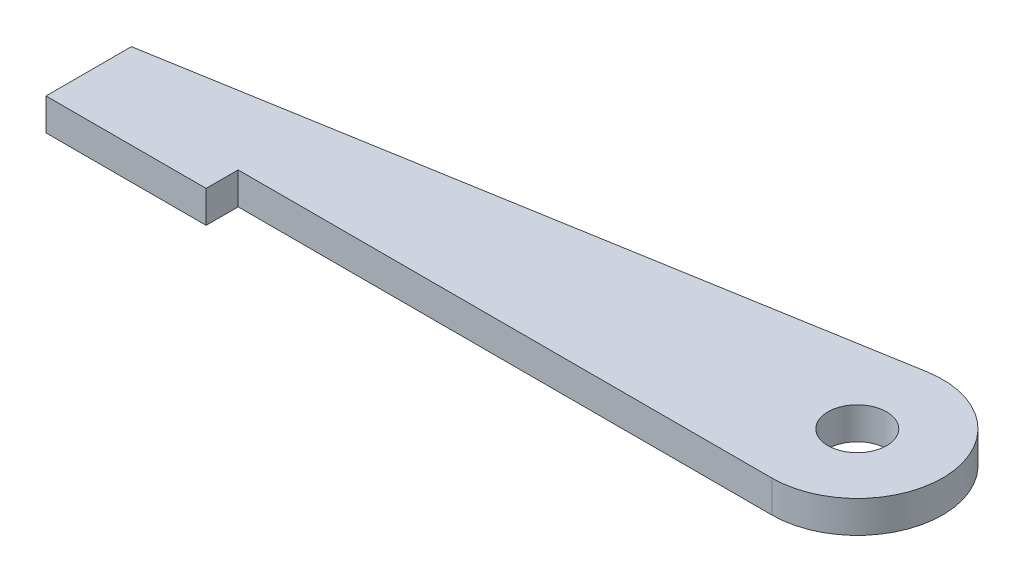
ISO-10303-21;
HEADER;
FILE_DESCRIPTION(('STEP AP214'),'2;1');
FILE_NAME('part.step','',(''),(''),'','','');
FILE_SCHEMA(('AUTOMOTIVE_DESIGN { 1 0 10303 214 1 1 1 1 }'));
ENDSEC;
DATA;
#1=APPLICATION_CONTEXT('core data for automotive mechanical design processes');
#2=APPLICATION_PROTOCOL_DEFINITION('international standard','automotive_design',2000,#1);
#3=PRODUCT_CONTEXT('',#1,'mechanical');
#4=PRODUCT('Part','Part','',(#3));
#5=PRODUCT_RELATED_PRODUCT_CATEGORY('part','',(#4));
#6=PRODUCT_DEFINITION_FORMATION('','',#4);
#7=PRODUCT_DEFINITION_CONTEXT('part definition',#1,'design');
#8=PRODUCT_DEFINITION('design','',#6,#7);
#9=PRODUCT_DEFINITION_SHAPE('','',#8);
#10=(LENGTH_UNIT() NAMED_UNIT(*) SI_UNIT(.MILLI.,.METRE.));
#11=(NAMED_UNIT(*) PLANE_ANGLE_UNIT() SI_UNIT($,.RADIAN.));
#12=(NAMED_UNIT(*) SI_UNIT($,.STERADIAN.) SOLID_ANGLE_UNIT());
#13=UNCERTAINTY_MEASURE_WITH_UNIT(LENGTH_MEASURE(1.E-05),#10,'distance_accuracy_value','');
#14=(GEOMETRIC_REPRESENTATION_CONTEXT(3) GLOBAL_UNCERTAINTY_ASSIGNED_CONTEXT((#13)) GLOBAL_UNIT_ASSIGNED_CONTEXT((#10,
#11,#12)) REPRESENTATION_CONTEXT('',''));
#15=CARTESIAN_POINT('',(0.,0.,0.));
#16=DIRECTION('',(0.,0.,1.));
#17=DIRECTION('',(1.,0.,0.));
#18=AXIS2_PLACEMENT_3D('',#15,#16,#17);
#19=CARTESIAN_POINT('',(65.0000000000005,3.,-2.99999999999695));
#20=DIRECTION('',(0.,1.,0.));
#21=DIRECTION('',(0.,0.,1.));
#22=AXIS2_PLACEMENT_3D('',#19,#20,#21);
#23=PLANE('',#22);
#24=DIRECTION('',(-0.985689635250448,0.,0.168570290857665));
#25=VECTOR('',#24,1.);
#26=CARTESIAN_POINT('',(0.,3.,0.));
#27=LINE('',#26,#25);
#28=CARTESIAN_POINT('',(63.6514376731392,3.,-10.8855170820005));
#29=VERTEX_POINT('',#28);
#30=CARTESIAN_POINT('',(0.,3.,0.));
#31=VERTEX_POINT('',#30);
#32=EDGE_CURVE('E118',#29,#31,#27,.T.);
#33=ORIENTED_EDGE('',*,*,#32,.T.);
#34=DIRECTION('',(0.,0.,1.));
#35=VECTOR('',#34,1.);
#36=CARTESIAN_POINT('',(0.,3.,0.));
#37=LINE('',#36,#35);
#38=CARTESIAN_POINT('',(0.,3.,8.));
#39=VERTEX_POINT('',#38);
#40=EDGE_CURVE('E99',#31,#39,#37,.T.);
#41=ORIENTED_EDGE('',*,*,#40,.T.);
#42=DIRECTION('',(1.,0.,0.));
#43=VECTOR('',#42,1.);
#44=CARTESIAN_POINT('',(0.,3.,8.));
#45=LINE('',#44,#43);
#46=CARTESIAN_POINT('',(15.,3.,8.));
#47=VERTEX_POINT('',#46);
#48=EDGE_CURVE('E121',#39,#47,#45,.T.);
#49=ORIENTED_EDGE('',*,*,#48,.T.);
#50=DIRECTION('',(0.,0.,-1.));
#51=VECTOR('',#50,1.);
#52=CARTESIAN_POINT('',(15.,3.,8.));
#53=LINE('',#52,#51);
#54=CARTESIAN_POINT('',(15.,3.,5.00000000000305));
#55=VERTEX_POINT('',#54);
#56=EDGE_CURVE('E123',#47,#55,#53,.T.);
#57=ORIENTED_EDGE('',*,*,#56,.T.);
#58=DIRECTION('',(1.,0.,0.));
#59=VECTOR('',#58,1.);
#60=CARTESIAN_POINT('',(15.,3.,5.00000000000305));
#61=LINE('',#60,#59);
#62=CARTESIAN_POINT('',(65.0000000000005,3.,5.00000000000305));
#63=VERTEX_POINT('',#62);
#64=EDGE_CURVE('E52',#55,#63,#61,.T.);
#65=ORIENTED_EDGE('',*,*,#64,.T.);
#66=CARTESIAN_POINT('',(65.0000000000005,3.,-2.99999999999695));
#67=DIRECTION('',(0.,1.,0.));
#68=DIRECTION('',(0.,0.,1.));
#69=AXIS2_PLACEMENT_3D('',#66,#67,#68);
#70=CIRCLE('',#69,8.);
#71=EDGE_CURVE('E47',#63,#29,#70,.T.);
#72=ORIENTED_EDGE('',*,*,#71,.T.);
#73=EDGE_LOOP('',(#33,#41,#49,#57,#65,#72));
#74=FACE_BOUND('',#73,.T.);
#75=CARTESIAN_POINT('',(65.0000000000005,3.,-2.99999999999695));
#76=DIRECTION('',(0.,1.,0.));
#77=DIRECTION('',(0.,0.,1.));
#78=AXIS2_PLACEMENT_3D('',#75,#76,#77);
#79=CIRCLE('',#78,2.75000000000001);
#80=CARTESIAN_POINT('',(65.0000000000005,3.,-0.249999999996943));
#81=VERTEX_POINT('',#80);
#82=EDGE_CURVE('E104',#81,#81,#79,.T.);
#83=ORIENTED_EDGE('',*,*,#82,.F.);
#84=EDGE_LOOP('',(#83));
#85=FACE_BOUND('',#84,.T.);
#86=ADVANCED_FACE('F32',(#74,#85),#23,.T.);
#87=CARTESIAN_POINT('',(65.0000000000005,0.,-2.99999999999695));
#88=DIRECTION('',(0.,1.,0.));
#89=DIRECTION('',(0.,0.,1.));
#90=AXIS2_PLACEMENT_3D('',#87,#88,#89);
#91=PLANE('',#90);
#92=DIRECTION('',(-0.985689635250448,0.,0.168570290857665));
#93=VECTOR('',#92,1.);
#94=CARTESIAN_POINT('',(0.,0.,0.));
#95=LINE('',#94,#93);
#96=CARTESIAN_POINT('',(63.6514376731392,0.,-10.8855170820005));
#97=VERTEX_POINT('',#96);
#98=CARTESIAN_POINT('',(0.,0.,0.));
#99=VERTEX_POINT('',#98);
#100=EDGE_CURVE('E90',#97,#99,#95,.T.);
#101=ORIENTED_EDGE('',*,*,#100,.F.);
#102=CARTESIAN_POINT('',(65.0000000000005,0.,-2.99999999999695));
#103=DIRECTION('',(0.,1.,0.));
#104=DIRECTION('',(0.,0.,1.));
#105=AXIS2_PLACEMENT_3D('',#102,#103,#104);
#106=CIRCLE('',#105,8.);
#107=CARTESIAN_POINT('',(65.0000000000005,0.,5.00000000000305));
#108=VERTEX_POINT('',#107);
#109=EDGE_CURVE('E116',#108,#97,#106,.T.);
#110=ORIENTED_EDGE('',*,*,#109,.F.);
#111=DIRECTION('',(1.,0.,0.));
#112=VECTOR('',#111,1.);
#113=CARTESIAN_POINT('',(15.,0.,5.00000000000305));
#114=LINE('',#113,#112);
#115=CARTESIAN_POINT('',(15.,0.,5.00000000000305));
#116=VERTEX_POINT('',#115);
#117=EDGE_CURVE('E114',#116,#108,#114,.T.);
#118=ORIENTED_EDGE('',*,*,#117,.F.);
#119=DIRECTION('',(0.,0.,-1.));
#120=VECTOR('',#119,1.);
#121=CARTESIAN_POINT('',(15.,0.,8.));
#122=LINE('',#121,#120);
#123=CARTESIAN_POINT('',(15.,0.,8.));
#124=VERTEX_POINT('',#123);
#125=EDGE_CURVE('E112',#124,#116,#122,.T.);
#126=ORIENTED_EDGE('',*,*,#125,.F.);
#127=DIRECTION('',(1.,0.,0.));
#128=VECTOR('',#127,1.);
#129=CARTESIAN_POINT('',(0.,0.,8.));
#130=LINE('',#129,#128);
#131=CARTESIAN_POINT('',(0.,0.,8.));
#132=VERTEX_POINT('',#131);
#133=EDGE_CURVE('E92',#132,#124,#130,.T.);
#134=ORIENTED_EDGE('',*,*,#133,.F.);
#135=DIRECTION('',(0.,0.,1.));
#136=VECTOR('',#135,1.);
#137=CARTESIAN_POINT('',(0.,0.,0.));
#138=LINE('',#137,#136);
#139=EDGE_CURVE('E85',#99,#132,#138,.T.);
#140=ORIENTED_EDGE('',*,*,#139,.F.);
#141=EDGE_LOOP('',(#101,#110,#118,#126,#134,#140));
#142=FACE_BOUND('',#141,.T.);
#143=CARTESIAN_POINT('',(65.0000000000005,0.,-2.99999999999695));
#144=DIRECTION('',(0.,1.,0.));
#145=DIRECTION('',(0.,0.,1.));
#146=AXIS2_PLACEMENT_3D('',#143,#144,#145);
#147=CIRCLE('',#146,2.75000000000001);
#148=CARTESIAN_POINT('',(65.0000000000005,0.,-0.249999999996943));
#149=VERTEX_POINT('',#148);
#150=EDGE_CURVE('E107',#149,#149,#147,.T.);
#151=ORIENTED_EDGE('',*,*,#150,.T.);
#152=EDGE_LOOP('',(#151));
#153=FACE_BOUND('',#152,.T.);
#154=ADVANCED_FACE('F86',(#142,#153),#91,.F.);
#155=CARTESIAN_POINT('',(0.,3.,0.));
#156=DIRECTION('',(0.168570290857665,0.,0.985689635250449));
#157=DIRECTION('',(0.985689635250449,0.,-0.168570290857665));
#158=AXIS2_PLACEMENT_3D('',#155,#156,#157);
#159=PLANE('',#158);
#160=ORIENTED_EDGE('',*,*,#100,.T.);
#161=DIRECTION('',(0.,-1.,0.));
#162=VECTOR('',#161,1.);
#163=CARTESIAN_POINT('',(0.,3.,0.));
#164=LINE('',#163,#162);
#165=EDGE_CURVE('E11',#31,#99,#164,.T.);
#166=ORIENTED_EDGE('',*,*,#165,.F.);
#167=ORIENTED_EDGE('',*,*,#32,.F.);
#168=DIRECTION('',(0.,-1.,0.));
#169=VECTOR('',#168,1.);
#170=CARTESIAN_POINT('',(63.6514376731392,3.,-10.8855170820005));
#171=LINE('',#170,#169);
#172=EDGE_CURVE('E103',#29,#97,#171,.T.);
#173=ORIENTED_EDGE('',*,*,#172,.T.);
#174=EDGE_LOOP('',(#160,#166,#167,#173));
#175=FACE_BOUND('',#174,.T.);
#176=ADVANCED_FACE('F34',(#175),#159,.F.);
#177=CARTESIAN_POINT('',(0.,3.,0.));
#178=DIRECTION('',(1.,0.,0.));
#179=DIRECTION('',(0.,0.,-1.));
#180=AXIS2_PLACEMENT_3D('',#177,#178,#179);
#181=PLANE('',#180);
#182=ORIENTED_EDGE('',*,*,#139,.T.);
#183=DIRECTION('',(0.,-1.,0.));
#184=VECTOR('',#183,1.);
#185=CARTESIAN_POINT('',(0.,3.,8.));
#186=LINE('',#185,#184);
#187=EDGE_CURVE('E40',#39,#132,#186,.T.);
#188=ORIENTED_EDGE('',*,*,#187,.F.);
#189=ORIENTED_EDGE('',*,*,#40,.F.);
#190=ORIENTED_EDGE('',*,*,#165,.T.);
#191=EDGE_LOOP('',(#182,#188,#189,#190));
#192=FACE_BOUND('',#191,.T.);
#193=ADVANCED_FACE('F98',(#192),#181,.F.);
#194=CARTESIAN_POINT('',(0.,3.,8.));
#195=DIRECTION('',(0.,0.,-1.));
#196=DIRECTION('',(-1.,0.,0.));
#197=AXIS2_PLACEMENT_3D('',#194,#195,#196);
#198=PLANE('',#197);
#199=ORIENTED_EDGE('',*,*,#133,.T.);
#200=DIRECTION('',(0.,-1.,0.));
#201=VECTOR('',#200,1.);
#202=CARTESIAN_POINT('',(15.,3.,8.));
#203=LINE('',#202,#201);
#204=EDGE_CURVE('E134',#47,#124,#203,.T.);
#205=ORIENTED_EDGE('',*,*,#204,.F.);
#206=ORIENTED_EDGE('',*,*,#48,.F.);
#207=ORIENTED_EDGE('',*,*,#187,.T.);
#208=EDGE_LOOP('',(#199,#205,#206,#207));
#209=FACE_BOUND('',#208,.T.);
#210=ADVANCED_FACE('F138',(#209),#198,.F.);
#211=CARTESIAN_POINT('',(15.,3.,8.));
#212=DIRECTION('',(-1.,0.,0.));
#213=DIRECTION('',(0.,0.,1.));
#214=AXIS2_PLACEMENT_3D('',#211,#212,#213);
#215=PLANE('',#214);
#216=ORIENTED_EDGE('',*,*,#125,.T.);
#217=DIRECTION('',(0.,-1.,0.));
#218=VECTOR('',#217,1.);
#219=CARTESIAN_POINT('',(15.,3.,5.00000000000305));
#220=LINE('',#219,#218);
#221=EDGE_CURVE('E131',#55,#116,#220,.T.);
#222=ORIENTED_EDGE('',*,*,#221,.F.);
#223=ORIENTED_EDGE('',*,*,#56,.F.);
#224=ORIENTED_EDGE('',*,*,#204,.T.);
#225=EDGE_LOOP('',(#216,#222,#223,#224));
#226=FACE_BOUND('',#225,.T.);
#227=ADVANCED_FACE('F144',(#226),#215,.F.);
#228=CARTESIAN_POINT('',(15.,3.,5.00000000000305));
#229=DIRECTION('',(0.,0.,-1.));
#230=DIRECTION('',(-1.,0.,0.));
#231=AXIS2_PLACEMENT_3D('',#228,#229,#230);
#232=PLANE('',#231);
#233=ORIENTED_EDGE('',*,*,#117,.T.);
#234=DIRECTION('',(0.,-1.,0.));
#235=VECTOR('',#234,1.);
#236=CARTESIAN_POINT('',(65.0000000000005,3.,5.00000000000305));
#237=LINE('',#236,#235);
#238=EDGE_CURVE('E128',#63,#108,#237,.T.);
#239=ORIENTED_EDGE('',*,*,#238,.F.);
#240=ORIENTED_EDGE('',*,*,#64,.F.);
#241=ORIENTED_EDGE('',*,*,#221,.T.);
#242=EDGE_LOOP('',(#233,#239,#240,#241));
#243=FACE_BOUND('',#242,.T.);
#244=ADVANCED_FACE('F147',(#243),#232,.F.);
#245=CARTESIAN_POINT('',(65.0000000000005,3.,-2.99999999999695));
#246=DIRECTION('',(0.,-1.,0.));
#247=DIRECTION('',(0.,0.,-1.));
#248=AXIS2_PLACEMENT_3D('',#245,#246,#247);
#249=CYLINDRICAL_SURFACE('',#248,8.);
#250=ORIENTED_EDGE('',*,*,#109,.T.);
#251=ORIENTED_EDGE('',*,*,#172,.F.);
#252=ORIENTED_EDGE('',*,*,#71,.F.);
#253=ORIENTED_EDGE('',*,*,#238,.T.);
#254=EDGE_LOOP('',(#250,#251,#252,#253));
#255=FACE_BOUND('',#254,.T.);
#256=ADVANCED_FACE('F149',(#255),#249,.T.);
#257=CARTESIAN_POINT('',(65.0000000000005,3.,-2.99999999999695));
#258=DIRECTION('',(0.,-1.,0.));
#259=DIRECTION('',(0.,0.,-1.));
#260=AXIS2_PLACEMENT_3D('',#257,#258,#259);
#261=CYLINDRICAL_SURFACE('',#260,2.75000000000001);
#262=ORIENTED_EDGE('',*,*,#82,.T.);
#263=EDGE_LOOP('',(#262));
#264=FACE_BOUND('',#263,.T.);
#265=ORIENTED_EDGE('',*,*,#150,.F.);
#266=EDGE_LOOP('',(#265));
#267=FACE_BOUND('',#266,.T.);
#268=ADVANCED_FACE('F151',(#264,#267),#261,.F.);
#269=CLOSED_SHELL('',(#86,#154,#176,#193,#210,#227,#244,#256,#268));
#270=MANIFOLD_SOLID_BREP('B2',#269);
#271=ADVANCED_BREP_SHAPE_REPRESENTATION('',(#18,#270),#14);
#272=SHAPE_DEFINITION_REPRESENTATION(#9,#271);
ENDSEC;
END-ISO-10303-21;
